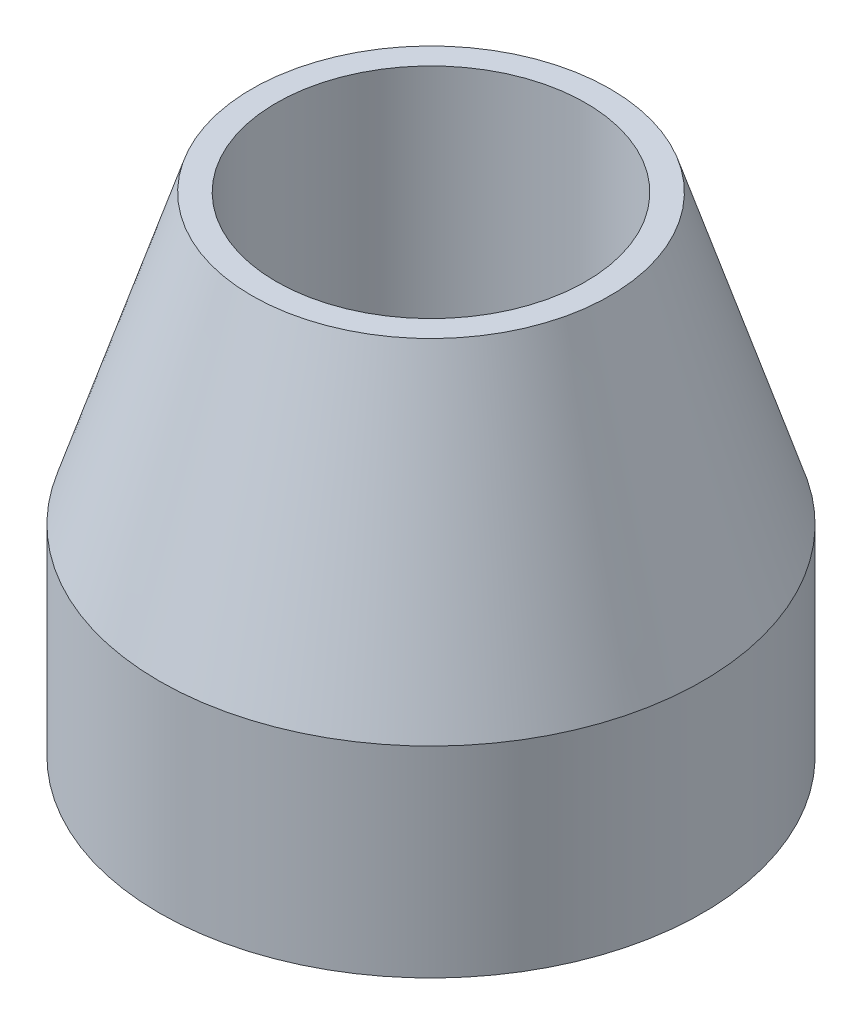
from build123d import *


with BuildPart() as part:
    # Esquisse1 → Base-R_volution (revolve)
    with BuildSketch(Plane.XY, mode=Mode.PRIVATE) as base_r_volution_sk:
        Polygon((519.356753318, 60.465716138), (519.356753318, 43.156092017), (515.215732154, 43.156092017), (515.215732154, 50.274068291), (518.491618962, 60.465716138), align=None)
    revolve(base_r_volution_sk.sketch.rotate(Axis((524.841177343, 60.465716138, 0), (0, -1, 0)), 270), axis=Axis((524.841177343, 60.465716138, 0), (0, -1, 0)))


solid = part.part
